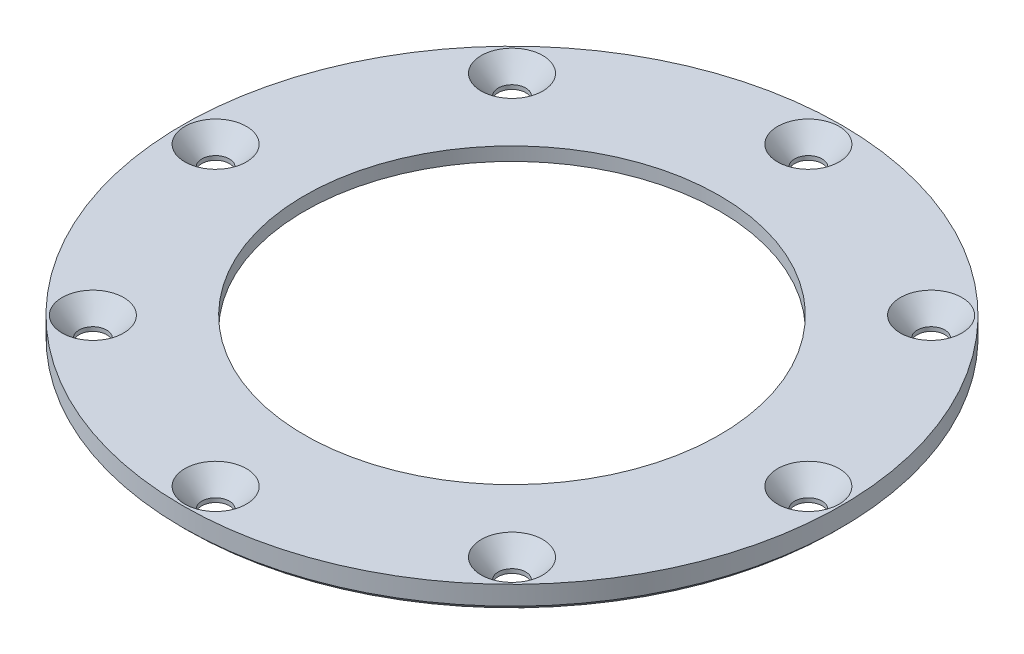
ISO-10303-21;
HEADER;
FILE_DESCRIPTION(('STEP AP214'),'2;1');
FILE_NAME('part.step','',(''),(''),'','','');
FILE_SCHEMA(('AUTOMOTIVE_DESIGN { 1 0 10303 214 1 1 1 1 }'));
ENDSEC;
DATA;
#1=APPLICATION_CONTEXT('core data for automotive mechanical design processes');
#2=APPLICATION_PROTOCOL_DEFINITION('international standard','automotive_design',2000,#1);
#3=PRODUCT_CONTEXT('',#1,'mechanical');
#4=PRODUCT('Part','Part','',(#3));
#5=PRODUCT_RELATED_PRODUCT_CATEGORY('part','',(#4));
#6=PRODUCT_DEFINITION_FORMATION('','',#4);
#7=PRODUCT_DEFINITION_CONTEXT('part definition',#1,'design');
#8=PRODUCT_DEFINITION('design','',#6,#7);
#9=PRODUCT_DEFINITION_SHAPE('','',#8);
#10=(LENGTH_UNIT() NAMED_UNIT(*) SI_UNIT(.MILLI.,.METRE.));
#11=(NAMED_UNIT(*) PLANE_ANGLE_UNIT() SI_UNIT($,.RADIAN.));
#12=(NAMED_UNIT(*) SI_UNIT($,.STERADIAN.) SOLID_ANGLE_UNIT());
#13=UNCERTAINTY_MEASURE_WITH_UNIT(LENGTH_MEASURE(1.E-05),#10,'distance_accuracy_value','');
#14=(GEOMETRIC_REPRESENTATION_CONTEXT(3) GLOBAL_UNCERTAINTY_ASSIGNED_CONTEXT((#13)) GLOBAL_UNIT_ASSIGNED_CONTEXT((#10,
#11,#12)) REPRESENTATION_CONTEXT('',''));
#15=CARTESIAN_POINT('',(0.,0.,0.));
#16=DIRECTION('',(0.,0.,1.));
#17=DIRECTION('',(1.,0.,0.));
#18=AXIS2_PLACEMENT_3D('',#15,#16,#17);
#19=CARTESIAN_POINT('',(-35.306,2.54,0.));
#20=DIRECTION('',(0.,-1.,0.));
#21=DIRECTION('',(0.,0.,-1.));
#22=AXIS2_PLACEMENT_3D('',#19,#20,#21);
#23=PLANE('',#22);
#24=CARTESIAN_POINT('',(22.4506403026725,2.54,22.4506403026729));
#25=DIRECTION('',(0.,1.,0.));
#26=DIRECTION('',(0.,0.,1.));
#27=AXIS2_PLACEMENT_3D('',#24,#25,#26);
#28=CIRCLE('',#27,3.2991171);
#29=CARTESIAN_POINT('',(22.4506403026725,2.54,25.7497574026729));
#30=VERTEX_POINT('',#29);
#31=EDGE_CURVE('E81',#30,#30,#28,.T.);
#32=ORIENTED_EDGE('',*,*,#31,.F.);
#33=EDGE_LOOP('',(#32));
#34=FACE_BOUND('',#33,.T.);
#35=CARTESIAN_POINT('',(31.7499999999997,2.54,0.));
#36=DIRECTION('',(0.,1.,0.));
#37=DIRECTION('',(0.,0.,1.));
#38=AXIS2_PLACEMENT_3D('',#35,#36,#37);
#39=CIRCLE('',#38,3.2991171);
#40=CARTESIAN_POINT('',(31.7499999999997,2.54,3.2991171));
#41=VERTEX_POINT('',#40);
#42=EDGE_CURVE('E87',#41,#41,#39,.T.);
#43=ORIENTED_EDGE('',*,*,#42,.F.);
#44=EDGE_LOOP('',(#43));
#45=FACE_BOUND('',#44,.T.);
#46=CARTESIAN_POINT('',(22.4506403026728,2.54,-22.4506403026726));
#47=DIRECTION('',(0.,1.,0.));
#48=DIRECTION('',(0.,0.,1.));
#49=AXIS2_PLACEMENT_3D('',#46,#47,#48);
#50=CIRCLE('',#49,3.2991171);
#51=CARTESIAN_POINT('',(22.4506403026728,2.54,-19.1515232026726));
#52=VERTEX_POINT('',#51);
#53=EDGE_CURVE('E93',#52,#52,#50,.T.);
#54=ORIENTED_EDGE('',*,*,#53,.F.);
#55=EDGE_LOOP('',(#54));
#56=FACE_BOUND('',#55,.T.);
#57=CARTESIAN_POINT('',(1.12573502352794E-13,2.54,-31.7499999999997));
#58=DIRECTION('',(0.,1.,0.));
#59=DIRECTION('',(0.,0.,1.));
#60=AXIS2_PLACEMENT_3D('',#57,#58,#59);
#61=CIRCLE('',#60,3.2991171);
#62=CARTESIAN_POINT('',(1.12573502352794E-13,2.54,-28.4508828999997));
#63=VERTEX_POINT('',#62);
#64=EDGE_CURVE('E99',#63,#63,#61,.T.);
#65=ORIENTED_EDGE('',*,*,#64,.F.);
#66=EDGE_LOOP('',(#65));
#67=FACE_BOUND('',#66,.T.);
#68=CARTESIAN_POINT('',(-22.4506403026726,2.54,-22.4506403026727));
#69=DIRECTION('',(0.,1.,0.));
#70=DIRECTION('',(0.,0.,1.));
#71=AXIS2_PLACEMENT_3D('',#68,#69,#70);
#72=CIRCLE('',#71,3.2991171);
#73=CARTESIAN_POINT('',(-22.4506403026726,2.54,-19.1515232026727));
#74=VERTEX_POINT('',#73);
#75=EDGE_CURVE('E105',#74,#74,#72,.T.);
#76=ORIENTED_EDGE('',*,*,#75,.F.);
#77=EDGE_LOOP('',(#76));
#78=FACE_BOUND('',#77,.T.);
#79=CARTESIAN_POINT('',(-31.7499999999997,2.54,0.));
#80=DIRECTION('',(0.,1.,0.));
#81=DIRECTION('',(0.,0.,1.));
#82=AXIS2_PLACEMENT_3D('',#79,#80,#81);
#83=CIRCLE('',#82,3.2991171);
#84=CARTESIAN_POINT('',(-31.7499999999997,2.54,3.2991171));
#85=VERTEX_POINT('',#84);
#86=EDGE_CURVE('E111',#85,#85,#83,.T.);
#87=ORIENTED_EDGE('',*,*,#86,.F.);
#88=EDGE_LOOP('',(#87));
#89=FACE_BOUND('',#88,.T.);
#90=CARTESIAN_POINT('',(0.,2.54,0.));
#91=DIRECTION('',(0.,-1.,0.));
#92=DIRECTION('',(0.,0.,-1.));
#93=AXIS2_PLACEMENT_3D('',#90,#91,#92);
#94=CIRCLE('',#93,35.306);
#95=CARTESIAN_POINT('',(0.,2.54,-35.306));
#96=VERTEX_POINT('',#95);
#97=EDGE_CURVE('E69',#96,#96,#94,.T.);
#98=ORIENTED_EDGE('',*,*,#97,.F.);
#99=EDGE_LOOP('',(#98));
#100=FACE_BOUND('',#99,.T.);
#101=CARTESIAN_POINT('',(0.,2.54,0.));
#102=DIRECTION('',(0.,-1.,0.));
#103=DIRECTION('',(0.,0.,-1.));
#104=AXIS2_PLACEMENT_3D('',#101,#102,#103);
#105=CIRCLE('',#104,22.225);
#106=CARTESIAN_POINT('',(0.,2.54,-22.225));
#107=VERTEX_POINT('',#106);
#108=EDGE_CURVE('E121',#107,#107,#105,.T.);
#109=ORIENTED_EDGE('',*,*,#108,.T.);
#110=EDGE_LOOP('',(#109));
#111=FACE_BOUND('',#110,.T.);
#112=CARTESIAN_POINT('',(-3.34282567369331E-13,2.54,31.7499999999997));
#113=DIRECTION('',(0.,1.,0.));
#114=DIRECTION('',(0.,0.,1.));
#115=AXIS2_PLACEMENT_3D('',#112,#113,#114);
#116=CIRCLE('',#115,3.2991171);
#117=CARTESIAN_POINT('',(-3.34282567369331E-13,2.54,35.0491170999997));
#118=VERTEX_POINT('',#117);
#119=EDGE_CURVE('E75',#118,#118,#116,.T.);
#120=ORIENTED_EDGE('',*,*,#119,.F.);
#121=EDGE_LOOP('',(#120));
#122=FACE_BOUND('',#121,.T.);
#123=CARTESIAN_POINT('',(-22.450640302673,2.54,22.4506403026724));
#124=DIRECTION('',(0.,1.,0.));
#125=DIRECTION('',(0.,0.,1.));
#126=AXIS2_PLACEMENT_3D('',#123,#124,#125);
#127=CIRCLE('',#126,3.2991171);
#128=CARTESIAN_POINT('',(-22.450640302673,2.54,25.7497574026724));
#129=VERTEX_POINT('',#128);
#130=EDGE_CURVE('E172',#129,#129,#127,.T.);
#131=ORIENTED_EDGE('',*,*,#130,.F.);
#132=EDGE_LOOP('',(#131));
#133=FACE_BOUND('',#132,.T.);
#134=ADVANCED_FACE('F48',(#34,#45,#56,#67,#78,#89,#100,#111,#122,#133),#23,.F.);
#135=CARTESIAN_POINT('',(0.,0.,0.));
#136=DIRECTION('',(0.,-1.,0.));
#137=DIRECTION('',(0.,0.,-1.));
#138=AXIS2_PLACEMENT_3D('',#135,#136,#137);
#139=CONICAL_SURFACE('',#138,24.13,1.0471975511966);
#140=CARTESIAN_POINT('',(0.,1.09985226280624,0.));
#141=DIRECTION('',(0.,-1.,0.));
#142=DIRECTION('',(0.,0.,-1.));
#143=AXIS2_PLACEMENT_3D('',#140,#141,#142);
#144=CIRCLE('',#143,22.225);
#145=CARTESIAN_POINT('',(0.,1.09985226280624,-22.225));
#146=VERTEX_POINT('',#145);
#147=EDGE_CURVE('E115',#146,#146,#144,.T.);
#148=ORIENTED_EDGE('',*,*,#147,.F.);
#149=EDGE_LOOP('',(#148));
#150=FACE_BOUND('',#149,.T.);
#151=CARTESIAN_POINT('',(0.,0.,0.));
#152=DIRECTION('',(0.,-1.,0.));
#153=DIRECTION('',(0.,0.,-1.));
#154=AXIS2_PLACEMENT_3D('',#151,#152,#153);
#155=CIRCLE('',#154,24.13);
#156=CARTESIAN_POINT('',(0.,0.,-24.13));
#157=VERTEX_POINT('',#156);
#158=EDGE_CURVE('E63',#157,#157,#155,.T.);
#159=ORIENTED_EDGE('',*,*,#158,.T.);
#160=EDGE_LOOP('',(#159));
#161=FACE_BOUND('',#160,.T.);
#162=ADVANCED_FACE('F180',(#150,#161),#139,.F.);
#163=CARTESIAN_POINT('',(-24.13,0.,0.));
#164=DIRECTION('',(0.,1.,0.));
#165=DIRECTION('',(0.,0.,1.));
#166=AXIS2_PLACEMENT_3D('',#163,#164,#165);
#167=PLANE('',#166);
#168=CARTESIAN_POINT('',(0.,0.,0.));
#169=DIRECTION('',(0.,1.,0.));
#170=DIRECTION('',(0.,0.,1.));
#171=AXIS2_PLACEMENT_3D('',#168,#169,#170);
#172=CIRCLE('',#171,34.798);
#173=CARTESIAN_POINT('',(0.,0.,34.798));
#174=VERTEX_POINT('',#173);
#175=EDGE_CURVE('E56',#174,#174,#172,.F.);
#176=ORIENTED_EDGE('',*,*,#175,.T.);
#177=EDGE_LOOP('',(#176));
#178=FACE_BOUND('',#177,.T.);
#179=CARTESIAN_POINT('',(-22.450640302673,0.,22.4506403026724));
#180=DIRECTION('',(0.,1.,0.));
#181=DIRECTION('',(0.,0.,1.));
#182=AXIS2_PLACEMENT_3D('',#179,#180,#181);
#183=CIRCLE('',#182,1.47319999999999);
#184=CARTESIAN_POINT('',(-22.450640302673,0.,23.9238403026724));
#185=VERTEX_POINT('',#184);
#186=EDGE_CURVE('E72',#185,#185,#183,.T.);
#187=ORIENTED_EDGE('',*,*,#186,.T.);
#188=EDGE_LOOP('',(#187));
#189=FACE_BOUND('',#188,.T.);
#190=CARTESIAN_POINT('',(-3.34282567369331E-13,0.,31.7499999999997));
#191=DIRECTION('',(0.,1.,0.));
#192=DIRECTION('',(0.,0.,1.));
#193=AXIS2_PLACEMENT_3D('',#190,#191,#192);
#194=CIRCLE('',#193,1.47319999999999);
#195=CARTESIAN_POINT('',(-3.34282567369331E-13,0.,33.2231999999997));
#196=VERTEX_POINT('',#195);
#197=EDGE_CURVE('E77',#196,#196,#194,.T.);
#198=ORIENTED_EDGE('',*,*,#197,.T.);
#199=EDGE_LOOP('',(#198));
#200=FACE_BOUND('',#199,.T.);
#201=CARTESIAN_POINT('',(22.4506403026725,0.,22.4506403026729));
#202=DIRECTION('',(0.,1.,0.));
#203=DIRECTION('',(0.,0.,1.));
#204=AXIS2_PLACEMENT_3D('',#201,#202,#203);
#205=CIRCLE('',#204,1.47319999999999);
#206=CARTESIAN_POINT('',(22.4506403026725,0.,23.9238403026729));
#207=VERTEX_POINT('',#206);
#208=EDGE_CURVE('E83',#207,#207,#205,.T.);
#209=ORIENTED_EDGE('',*,*,#208,.T.);
#210=EDGE_LOOP('',(#209));
#211=FACE_BOUND('',#210,.T.);
#212=CARTESIAN_POINT('',(31.7499999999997,0.,0.));
#213=DIRECTION('',(0.,1.,0.));
#214=DIRECTION('',(0.,0.,1.));
#215=AXIS2_PLACEMENT_3D('',#212,#213,#214);
#216=CIRCLE('',#215,1.47319999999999);
#217=CARTESIAN_POINT('',(31.7499999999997,0.,1.4732));
#218=VERTEX_POINT('',#217);
#219=EDGE_CURVE('E89',#218,#218,#216,.T.);
#220=ORIENTED_EDGE('',*,*,#219,.T.);
#221=EDGE_LOOP('',(#220));
#222=FACE_BOUND('',#221,.T.);
#223=CARTESIAN_POINT('',(22.4506403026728,0.,-22.4506403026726));
#224=DIRECTION('',(0.,1.,0.));
#225=DIRECTION('',(0.,0.,1.));
#226=AXIS2_PLACEMENT_3D('',#223,#224,#225);
#227=CIRCLE('',#226,1.47319999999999);
#228=CARTESIAN_POINT('',(22.4506403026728,0.,-20.9774403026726));
#229=VERTEX_POINT('',#228);
#230=EDGE_CURVE('E95',#229,#229,#227,.T.);
#231=ORIENTED_EDGE('',*,*,#230,.T.);
#232=EDGE_LOOP('',(#231));
#233=FACE_BOUND('',#232,.T.);
#234=CARTESIAN_POINT('',(1.12573502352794E-13,0.,-31.7499999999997));
#235=DIRECTION('',(0.,1.,0.));
#236=DIRECTION('',(0.,0.,1.));
#237=AXIS2_PLACEMENT_3D('',#234,#235,#236);
#238=CIRCLE('',#237,1.47319999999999);
#239=CARTESIAN_POINT('',(1.12573502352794E-13,0.,-30.2767999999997));
#240=VERTEX_POINT('',#239);
#241=EDGE_CURVE('E101',#240,#240,#238,.T.);
#242=ORIENTED_EDGE('',*,*,#241,.T.);
#243=EDGE_LOOP('',(#242));
#244=FACE_BOUND('',#243,.T.);
#245=CARTESIAN_POINT('',(-22.4506403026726,0.,-22.4506403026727));
#246=DIRECTION('',(0.,1.,0.));
#247=DIRECTION('',(0.,0.,1.));
#248=AXIS2_PLACEMENT_3D('',#245,#246,#247);
#249=CIRCLE('',#248,1.47319999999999);
#250=CARTESIAN_POINT('',(-22.4506403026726,0.,-20.9774403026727));
#251=VERTEX_POINT('',#250);
#252=EDGE_CURVE('E107',#251,#251,#249,.T.);
#253=ORIENTED_EDGE('',*,*,#252,.T.);
#254=EDGE_LOOP('',(#253));
#255=FACE_BOUND('',#254,.T.);
#256=CARTESIAN_POINT('',(-31.7499999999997,0.,0.));
#257=DIRECTION('',(0.,1.,0.));
#258=DIRECTION('',(0.,0.,1.));
#259=AXIS2_PLACEMENT_3D('',#256,#257,#258);
#260=CIRCLE('',#259,1.47319999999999);
#261=CARTESIAN_POINT('',(-31.7499999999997,0.,1.47319999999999));
#262=VERTEX_POINT('',#261);
#263=EDGE_CURVE('E113',#262,#262,#260,.T.);
#264=ORIENTED_EDGE('',*,*,#263,.T.);
#265=EDGE_LOOP('',(#264));
#266=FACE_BOUND('',#265,.T.);
#267=ORIENTED_EDGE('',*,*,#158,.F.);
#268=EDGE_LOOP('',(#267));
#269=FACE_BOUND('',#268,.T.);
#270=ADVANCED_FACE('F186',(#178,#189,#200,#211,#222,#233,#244,#255,#266,#269),#167,.F.);
#271=CARTESIAN_POINT('',(0.,0.,0.));
#272=DIRECTION('',(0.,-1.,0.));
#273=DIRECTION('',(0.,0.,-1.));
#274=AXIS2_PLACEMENT_3D('',#271,#272,#273);
#275=CYLINDRICAL_SURFACE('',#274,35.306);
#276=CARTESIAN_POINT('',(0.,0.507999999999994,0.));
#277=DIRECTION('',(0.,1.,0.));
#278=DIRECTION('',(0.,0.,1.));
#279=AXIS2_PLACEMENT_3D('',#276,#277,#278);
#280=CIRCLE('',#279,35.306);
#281=CARTESIAN_POINT('',(0.,0.507999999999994,35.306));
#282=VERTEX_POINT('',#281);
#283=EDGE_CURVE('E12',#282,#282,#280,.T.);
#284=ORIENTED_EDGE('',*,*,#283,.T.);
#285=EDGE_LOOP('',(#284));
#286=FACE_BOUND('',#285,.T.);
#287=ORIENTED_EDGE('',*,*,#97,.T.);
#288=EDGE_LOOP('',(#287));
#289=FACE_BOUND('',#288,.T.);
#290=ADVANCED_FACE('F194',(#286,#289),#275,.T.);
#291=CARTESIAN_POINT('',(0.,0.,0.));
#292=DIRECTION('',(0.,-1.,0.));
#293=DIRECTION('',(0.,0.,-1.));
#294=AXIS2_PLACEMENT_3D('',#291,#292,#293);
#295=CYLINDRICAL_SURFACE('',#294,22.225);
#296=ORIENTED_EDGE('',*,*,#108,.F.);
#297=EDGE_LOOP('',(#296));
#298=FACE_BOUND('',#297,.T.);
#299=ORIENTED_EDGE('',*,*,#147,.T.);
#300=EDGE_LOOP('',(#299));
#301=FACE_BOUND('',#300,.T.);
#302=ADVANCED_FACE('F192',(#298,#301),#295,.F.);
#303=CARTESIAN_POINT('',(-31.7499999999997,2.54,0.));
#304=DIRECTION('',(0.,1.,0.));
#305=DIRECTION('',(0.,0.,1.));
#306=AXIS2_PLACEMENT_3D('',#303,#304,#305);
#307=CYLINDRICAL_SURFACE('',#306,1.47319999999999);
#308=CARTESIAN_POINT('',(-31.7499999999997,0.439522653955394,0.));
#309=DIRECTION('',(0.,1.,0.));
#310=DIRECTION('',(0.,0.,1.));
#311=AXIS2_PLACEMENT_3D('',#308,#309,#310);
#312=CIRCLE('',#311,1.4732);
#313=CARTESIAN_POINT('',(-31.7499999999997,0.439522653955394,1.4732));
#314=VERTEX_POINT('',#313);
#315=EDGE_CURVE('E116',#314,#314,#312,.T.);
#316=ORIENTED_EDGE('',*,*,#315,.T.);
#317=EDGE_LOOP('',(#316));
#318=FACE_BOUND('',#317,.T.);
#319=ORIENTED_EDGE('',*,*,#263,.F.);
#320=EDGE_LOOP('',(#319));
#321=FACE_BOUND('',#320,.T.);
#322=ADVANCED_FACE('F220',(#318,#321),#307,.F.);
#323=CARTESIAN_POINT('',(-31.7499999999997,2.54,0.));
#324=DIRECTION('',(0.,1.,0.));
#325=DIRECTION('',(0.,0.,1.));
#326=AXIS2_PLACEMENT_3D('',#323,#324,#325);
#327=CONICAL_SURFACE('',#326,3.2991171,0.715584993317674);
#328=ORIENTED_EDGE('',*,*,#315,.F.);
#329=EDGE_LOOP('',(#328));
#330=FACE_BOUND('',#329,.T.);
#331=ORIENTED_EDGE('',*,*,#86,.T.);
#332=EDGE_LOOP('',(#331));
#333=FACE_BOUND('',#332,.T.);
#334=ADVANCED_FACE('F222',(#330,#333),#327,.F.);
#335=CARTESIAN_POINT('',(-22.4506403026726,2.54,-22.4506403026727));
#336=DIRECTION('',(0.,1.,0.));
#337=DIRECTION('',(0.,0.,1.));
#338=AXIS2_PLACEMENT_3D('',#335,#336,#337);
#339=CYLINDRICAL_SURFACE('',#338,1.47319999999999);
#340=CARTESIAN_POINT('',(-22.4506403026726,0.439522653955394,-22.4506403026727));
#341=DIRECTION('',(0.,1.,0.));
#342=DIRECTION('',(0.,0.,1.));
#343=AXIS2_PLACEMENT_3D('',#340,#341,#342);
#344=CIRCLE('',#343,1.4732);
#345=CARTESIAN_POINT('',(-22.4506403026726,0.439522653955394,-20.9774403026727));
#346=VERTEX_POINT('',#345);
#347=EDGE_CURVE('E112',#346,#346,#344,.T.);
#348=ORIENTED_EDGE('',*,*,#347,.T.);
#349=EDGE_LOOP('',(#348));
#350=FACE_BOUND('',#349,.T.);
#351=ORIENTED_EDGE('',*,*,#252,.F.);
#352=EDGE_LOOP('',(#351));
#353=FACE_BOUND('',#352,.T.);
#354=ADVANCED_FACE('F228',(#350,#353),#339,.F.);
#355=CARTESIAN_POINT('',(-22.4506403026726,2.54,-22.4506403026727));
#356=DIRECTION('',(0.,1.,0.));
#357=DIRECTION('',(0.,0.,1.));
#358=AXIS2_PLACEMENT_3D('',#355,#356,#357);
#359=CONICAL_SURFACE('',#358,3.2991171,0.715584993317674);
#360=ORIENTED_EDGE('',*,*,#347,.F.);
#361=EDGE_LOOP('',(#360));
#362=FACE_BOUND('',#361,.T.);
#363=ORIENTED_EDGE('',*,*,#75,.T.);
#364=EDGE_LOOP('',(#363));
#365=FACE_BOUND('',#364,.T.);
#366=ADVANCED_FACE('F235',(#362,#365),#359,.F.);
#367=CARTESIAN_POINT('',(1.12573502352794E-13,2.54,-31.7499999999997));
#368=DIRECTION('',(0.,1.,0.));
#369=DIRECTION('',(0.,0.,1.));
#370=AXIS2_PLACEMENT_3D('',#367,#368,#369);
#371=CYLINDRICAL_SURFACE('',#370,1.47319999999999);
#372=CARTESIAN_POINT('',(1.12573502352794E-13,0.439522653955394,-31.7499999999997));
#373=DIRECTION('',(0.,1.,0.));
#374=DIRECTION('',(0.,0.,1.));
#375=AXIS2_PLACEMENT_3D('',#372,#373,#374);
#376=CIRCLE('',#375,1.4732);
#377=CARTESIAN_POINT('',(1.12573502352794E-13,0.439522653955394,-30.2767999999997));
#378=VERTEX_POINT('',#377);
#379=EDGE_CURVE('E106',#378,#378,#376,.T.);
#380=ORIENTED_EDGE('',*,*,#379,.T.);
#381=EDGE_LOOP('',(#380));
#382=FACE_BOUND('',#381,.T.);
#383=ORIENTED_EDGE('',*,*,#241,.F.);
#384=EDGE_LOOP('',(#383));
#385=FACE_BOUND('',#384,.T.);
#386=ADVANCED_FACE('F239',(#382,#385),#371,.F.);
#387=CARTESIAN_POINT('',(1.12573502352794E-13,2.54,-31.7499999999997));
#388=DIRECTION('',(0.,1.,0.));
#389=DIRECTION('',(0.,0.,1.));
#390=AXIS2_PLACEMENT_3D('',#387,#388,#389);
#391=CONICAL_SURFACE('',#390,3.2991171,0.715584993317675);
#392=ORIENTED_EDGE('',*,*,#379,.F.);
#393=EDGE_LOOP('',(#392));
#394=FACE_BOUND('',#393,.T.);
#395=ORIENTED_EDGE('',*,*,#64,.T.);
#396=EDGE_LOOP('',(#395));
#397=FACE_BOUND('',#396,.T.);
#398=ADVANCED_FACE('F243',(#394,#397),#391,.F.);
#399=CARTESIAN_POINT('',(22.4506403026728,2.54,-22.4506403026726));
#400=DIRECTION('',(0.,1.,0.));
#401=DIRECTION('',(0.,0.,1.));
#402=AXIS2_PLACEMENT_3D('',#399,#400,#401);
#403=CYLINDRICAL_SURFACE('',#402,1.47319999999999);
#404=CARTESIAN_POINT('',(22.4506403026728,0.439522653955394,-22.4506403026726));
#405=DIRECTION('',(0.,1.,0.));
#406=DIRECTION('',(0.,0.,1.));
#407=AXIS2_PLACEMENT_3D('',#404,#405,#406);
#408=CIRCLE('',#407,1.4732);
#409=CARTESIAN_POINT('',(22.4506403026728,0.439522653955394,-20.9774403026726));
#410=VERTEX_POINT('',#409);
#411=EDGE_CURVE('E100',#410,#410,#408,.T.);
#412=ORIENTED_EDGE('',*,*,#411,.T.);
#413=EDGE_LOOP('',(#412));
#414=FACE_BOUND('',#413,.T.);
#415=ORIENTED_EDGE('',*,*,#230,.F.);
#416=EDGE_LOOP('',(#415));
#417=FACE_BOUND('',#416,.T.);
#418=ADVANCED_FACE('F247',(#414,#417),#403,.F.);
#419=CARTESIAN_POINT('',(22.4506403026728,2.54,-22.4506403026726));
#420=DIRECTION('',(0.,1.,0.));
#421=DIRECTION('',(0.,0.,1.));
#422=AXIS2_PLACEMENT_3D('',#419,#420,#421);
#423=CONICAL_SURFACE('',#422,3.2991171,0.715584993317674);
#424=ORIENTED_EDGE('',*,*,#411,.F.);
#425=EDGE_LOOP('',(#424));
#426=FACE_BOUND('',#425,.T.);
#427=ORIENTED_EDGE('',*,*,#53,.T.);
#428=EDGE_LOOP('',(#427));
#429=FACE_BOUND('',#428,.T.);
#430=ADVANCED_FACE('F251',(#426,#429),#423,.F.);
#431=CARTESIAN_POINT('',(31.7499999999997,2.54,0.));
#432=DIRECTION('',(0.,1.,0.));
#433=DIRECTION('',(0.,0.,1.));
#434=AXIS2_PLACEMENT_3D('',#431,#432,#433);
#435=CYLINDRICAL_SURFACE('',#434,1.47319999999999);
#436=CARTESIAN_POINT('',(31.7499999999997,0.439522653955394,0.));
#437=DIRECTION('',(0.,1.,0.));
#438=DIRECTION('',(0.,0.,1.));
#439=AXIS2_PLACEMENT_3D('',#436,#437,#438);
#440=CIRCLE('',#439,1.4732);
#441=CARTESIAN_POINT('',(31.7499999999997,0.439522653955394,1.4732));
#442=VERTEX_POINT('',#441);
#443=EDGE_CURVE('E94',#442,#442,#440,.T.);
#444=ORIENTED_EDGE('',*,*,#443,.T.);
#445=EDGE_LOOP('',(#444));
#446=FACE_BOUND('',#445,.T.);
#447=ORIENTED_EDGE('',*,*,#219,.F.);
#448=EDGE_LOOP('',(#447));
#449=FACE_BOUND('',#448,.T.);
#450=ADVANCED_FACE('F255',(#446,#449),#435,.F.);
#451=CARTESIAN_POINT('',(31.7499999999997,2.54,0.));
#452=DIRECTION('',(0.,1.,0.));
#453=DIRECTION('',(0.,0.,1.));
#454=AXIS2_PLACEMENT_3D('',#451,#452,#453);
#455=CONICAL_SURFACE('',#454,3.2991171,0.715584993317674);
#456=ORIENTED_EDGE('',*,*,#443,.F.);
#457=EDGE_LOOP('',(#456));
#458=FACE_BOUND('',#457,.T.);
#459=ORIENTED_EDGE('',*,*,#42,.T.);
#460=EDGE_LOOP('',(#459));
#461=FACE_BOUND('',#460,.T.);
#462=ADVANCED_FACE('F259',(#458,#461),#455,.F.);
#463=CARTESIAN_POINT('',(22.4506403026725,2.54,22.4506403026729));
#464=DIRECTION('',(0.,1.,0.));
#465=DIRECTION('',(0.,0.,1.));
#466=AXIS2_PLACEMENT_3D('',#463,#464,#465);
#467=CYLINDRICAL_SURFACE('',#466,1.47319999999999);
#468=CARTESIAN_POINT('',(22.4506403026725,0.439522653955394,22.4506403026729));
#469=DIRECTION('',(0.,1.,0.));
#470=DIRECTION('',(0.,0.,1.));
#471=AXIS2_PLACEMENT_3D('',#468,#469,#470);
#472=CIRCLE('',#471,1.4732);
#473=CARTESIAN_POINT('',(22.4506403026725,0.439522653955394,23.9238403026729));
#474=VERTEX_POINT('',#473);
#475=EDGE_CURVE('E88',#474,#474,#472,.T.);
#476=ORIENTED_EDGE('',*,*,#475,.T.);
#477=EDGE_LOOP('',(#476));
#478=FACE_BOUND('',#477,.T.);
#479=ORIENTED_EDGE('',*,*,#208,.F.);
#480=EDGE_LOOP('',(#479));
#481=FACE_BOUND('',#480,.T.);
#482=ADVANCED_FACE('F263',(#478,#481),#467,.F.);
#483=CARTESIAN_POINT('',(22.4506403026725,2.54,22.4506403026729));
#484=DIRECTION('',(0.,1.,0.));
#485=DIRECTION('',(0.,0.,1.));
#486=AXIS2_PLACEMENT_3D('',#483,#484,#485);
#487=CONICAL_SURFACE('',#486,3.2991171,0.715584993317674);
#488=ORIENTED_EDGE('',*,*,#475,.F.);
#489=EDGE_LOOP('',(#488));
#490=FACE_BOUND('',#489,.T.);
#491=ORIENTED_EDGE('',*,*,#31,.T.);
#492=EDGE_LOOP('',(#491));
#493=FACE_BOUND('',#492,.T.);
#494=ADVANCED_FACE('F267',(#490,#493),#487,.F.);
#495=CARTESIAN_POINT('',(-3.34282567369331E-13,2.54,31.7499999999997));
#496=DIRECTION('',(0.,1.,0.));
#497=DIRECTION('',(0.,0.,1.));
#498=AXIS2_PLACEMENT_3D('',#495,#496,#497);
#499=CYLINDRICAL_SURFACE('',#498,1.47319999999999);
#500=CARTESIAN_POINT('',(-3.34282567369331E-13,0.439522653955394,31.7499999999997));
#501=DIRECTION('',(0.,1.,0.));
#502=DIRECTION('',(0.,0.,1.));
#503=AXIS2_PLACEMENT_3D('',#500,#501,#502);
#504=CIRCLE('',#503,1.4732);
#505=CARTESIAN_POINT('',(-3.34282567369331E-13,0.439522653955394,33.2231999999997));
#506=VERTEX_POINT('',#505);
#507=EDGE_CURVE('E82',#506,#506,#504,.T.);
#508=ORIENTED_EDGE('',*,*,#507,.T.);
#509=EDGE_LOOP('',(#508));
#510=FACE_BOUND('',#509,.T.);
#511=ORIENTED_EDGE('',*,*,#197,.F.);
#512=EDGE_LOOP('',(#511));
#513=FACE_BOUND('',#512,.T.);
#514=ADVANCED_FACE('F271',(#510,#513),#499,.F.);
#515=CARTESIAN_POINT('',(-3.34282567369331E-13,2.54,31.7499999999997));
#516=DIRECTION('',(0.,1.,0.));
#517=DIRECTION('',(0.,0.,1.));
#518=AXIS2_PLACEMENT_3D('',#515,#516,#517);
#519=CONICAL_SURFACE('',#518,3.2991171,0.715584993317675);
#520=ORIENTED_EDGE('',*,*,#507,.F.);
#521=EDGE_LOOP('',(#520));
#522=FACE_BOUND('',#521,.T.);
#523=ORIENTED_EDGE('',*,*,#119,.T.);
#524=EDGE_LOOP('',(#523));
#525=FACE_BOUND('',#524,.T.);
#526=ADVANCED_FACE('F275',(#522,#525),#519,.F.);
#527=CARTESIAN_POINT('',(-22.450640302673,2.54,22.4506403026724));
#528=DIRECTION('',(0.,1.,0.));
#529=DIRECTION('',(0.,0.,1.));
#530=AXIS2_PLACEMENT_3D('',#527,#528,#529);
#531=CYLINDRICAL_SURFACE('',#530,1.47319999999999);
#532=CARTESIAN_POINT('',(-22.450640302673,0.439522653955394,22.4506403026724));
#533=DIRECTION('',(0.,1.,0.));
#534=DIRECTION('',(0.,0.,1.));
#535=AXIS2_PLACEMENT_3D('',#532,#533,#534);
#536=CIRCLE('',#535,1.4732);
#537=CARTESIAN_POINT('',(-22.450640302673,0.439522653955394,23.9238403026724));
#538=VERTEX_POINT('',#537);
#539=EDGE_CURVE('E76',#538,#538,#536,.T.);
#540=ORIENTED_EDGE('',*,*,#539,.T.);
#541=EDGE_LOOP('',(#540));
#542=FACE_BOUND('',#541,.T.);
#543=ORIENTED_EDGE('',*,*,#186,.F.);
#544=EDGE_LOOP('',(#543));
#545=FACE_BOUND('',#544,.T.);
#546=ADVANCED_FACE('F279',(#542,#545),#531,.F.);
#547=CARTESIAN_POINT('',(-22.450640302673,2.54,22.4506403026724));
#548=DIRECTION('',(0.,1.,0.));
#549=DIRECTION('',(0.,0.,1.));
#550=AXIS2_PLACEMENT_3D('',#547,#548,#549);
#551=CONICAL_SURFACE('',#550,3.2991171,0.715584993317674);
#552=ORIENTED_EDGE('',*,*,#539,.F.);
#553=EDGE_LOOP('',(#552));
#554=FACE_BOUND('',#553,.T.);
#555=ORIENTED_EDGE('',*,*,#130,.T.);
#556=EDGE_LOOP('',(#555));
#557=FACE_BOUND('',#556,.T.);
#558=ADVANCED_FACE('F177',(#554,#557),#551,.F.);
#559=CARTESIAN_POINT('',(0.,0.,0.));
#560=DIRECTION('',(0.,1.,0.));
#561=DIRECTION('',(0.,0.,1.));
#562=AXIS2_PLACEMENT_3D('',#559,#560,#561);
#563=CONICAL_SURFACE('',#562,34.798,0.785398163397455);
#564=ORIENTED_EDGE('',*,*,#283,.F.);
#565=EDGE_LOOP('',(#564));
#566=FACE_BOUND('',#565,.T.);
#567=ORIENTED_EDGE('',*,*,#175,.F.);
#568=EDGE_LOOP('',(#567));
#569=FACE_BOUND('',#568,.T.);
#570=ADVANCED_FACE('F50',(#566,#569),#563,.T.);
#571=CLOSED_SHELL('',(#134,#162,#270,#290,#302,#322,#334,#354,#366,#386,#398,#418,#430,#450,
#462,#482,#494,#514,#526,#546,#558,#570));
#572=MANIFOLD_SOLID_BREP('B2',#571);
#573=ADVANCED_BREP_SHAPE_REPRESENTATION('',(#18,#572),#14);
#574=SHAPE_DEFINITION_REPRESENTATION(#9,#573);
ENDSEC;
END-ISO-10303-21;
